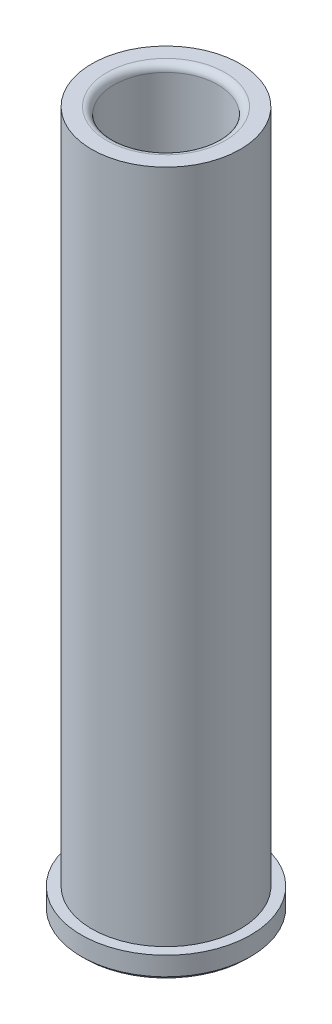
from build123d import *

# Parameters (mm, degrees)
FILLET1_R = 1.524


with BuildPart() as part:
    # Sketch1 → Revolve1 (revolve)
    with BuildSketch(Plane.XY, mode=Mode.PRIVATE) as revolve1_sk:
        Polygon((-17.3609, 0), (-18.1229, 0.762), (-18.1229, 4.7625), (-15.88135, 4.7625), (-15.88135, 149.225), (-11.11885, 149.225), (-11.11885, 0.762), (-11.88085, 0), align=None)
    revolve(revolve1_sk.sketch.rotate(Axis((0, -1000, 0), (0, 1, 0)), 180), axis=Axis((0, -1000, 0), (0, 1, 0)))

    # Fillet1
    fillet1_edges = [part.edges().sort_by_distance(p)[0] for p in [
        (-11.11885, 149.225, 0),
    ]]
    fillet(fillet1_edges, radius=FILLET1_R)


solid = part.part
